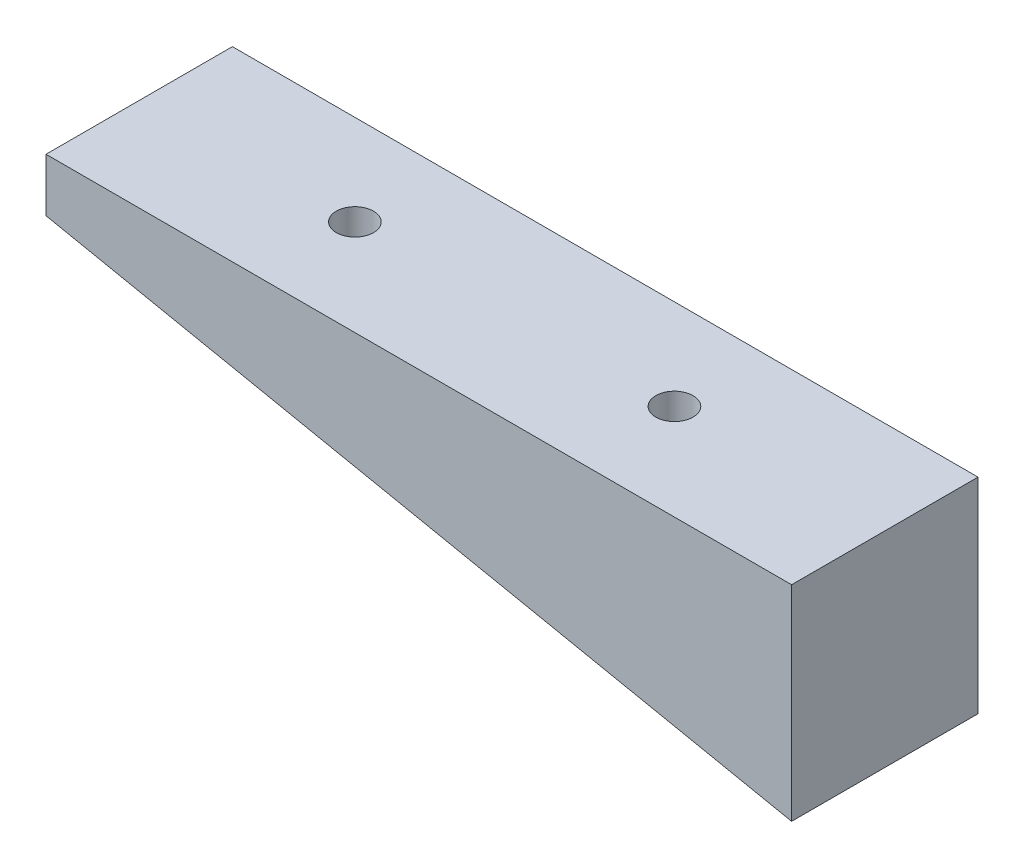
ISO-10303-21;
HEADER;
FILE_DESCRIPTION(('STEP AP214'),'2;1');
FILE_NAME('part.step','',(''),(''),'','','');
FILE_SCHEMA(('AUTOMOTIVE_DESIGN { 1 0 10303 214 1 1 1 1 }'));
ENDSEC;
DATA;
#1=APPLICATION_CONTEXT('core data for automotive mechanical design processes');
#2=APPLICATION_PROTOCOL_DEFINITION('international standard','automotive_design',2000,#1);
#3=PRODUCT_CONTEXT('',#1,'mechanical');
#4=PRODUCT('Part','Part','',(#3));
#5=PRODUCT_RELATED_PRODUCT_CATEGORY('part','',(#4));
#6=PRODUCT_DEFINITION_FORMATION('','',#4);
#7=PRODUCT_DEFINITION_CONTEXT('part definition',#1,'design');
#8=PRODUCT_DEFINITION('design','',#6,#7);
#9=PRODUCT_DEFINITION_SHAPE('','',#8);
#10=(LENGTH_UNIT() NAMED_UNIT(*) SI_UNIT(.MILLI.,.METRE.));
#11=(NAMED_UNIT(*) PLANE_ANGLE_UNIT() SI_UNIT($,.RADIAN.));
#12=(NAMED_UNIT(*) SI_UNIT($,.STERADIAN.) SOLID_ANGLE_UNIT());
#13=UNCERTAINTY_MEASURE_WITH_UNIT(LENGTH_MEASURE(1.E-05),#10,'distance_accuracy_value','');
#14=(GEOMETRIC_REPRESENTATION_CONTEXT(3) GLOBAL_UNCERTAINTY_ASSIGNED_CONTEXT((#13)) GLOBAL_UNIT_ASSIGNED_CONTEXT((#10,
#11,#12)) REPRESENTATION_CONTEXT('',''));
#15=CARTESIAN_POINT('',(0.,0.,0.));
#16=DIRECTION('',(0.,0.,1.));
#17=DIRECTION('',(1.,0.,0.));
#18=AXIS2_PLACEMENT_3D('',#15,#16,#17);
#19=CARTESIAN_POINT('',(44.4846801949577,19.9025072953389,34.));
#20=DIRECTION('',(0.,-1.,0.));
#21=DIRECTION('',(0.,0.,-1.));
#22=AXIS2_PLACEMENT_3D('',#19,#20,#21);
#23=CYLINDRICAL_SURFACE('',#22,11.);
#24=CARTESIAN_POINT('',(44.4846801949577,-1.37367665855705,34.));
#25=DIRECTION('',(-0.199367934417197,-0.97992470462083,0.));
#26=DIRECTION('',(0.97992470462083,-0.199367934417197,0.));
#27=AXIS2_PLACEMENT_3D('',#24,#25,#26);
#28=ELLIPSE('',#27,11.225352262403,11.);
#29=CARTESIAN_POINT('',(55.4846801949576,-3.61165195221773,34.));
#30=VERTEX_POINT('',#29);
#31=EDGE_CURVE('E20',#30,#30,#28,.F.);
#32=ORIENTED_EDGE('',*,*,#31,.F.);
#33=EDGE_LOOP('',(#32));
#34=FACE_BOUND('',#33,.T.);
#35=CARTESIAN_POINT('',(44.4846801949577,19.9025072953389,34.));
#36=DIRECTION('',(0.,-1.,0.));
#37=DIRECTION('',(0.,0.,-1.));
#38=AXIS2_PLACEMENT_3D('',#35,#36,#37);
#39=CIRCLE('',#38,11.);
#40=CARTESIAN_POINT('',(44.4846801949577,19.9025072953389,23.));
#41=VERTEX_POINT('',#40);
#42=EDGE_CURVE('E107',#41,#41,#39,.F.);
#43=ORIENTED_EDGE('',*,*,#42,.T.);
#44=EDGE_LOOP('',(#43));
#45=FACE_BOUND('',#44,.T.);
#46=ADVANCED_FACE('F16',(#34,#45),#23,.F.);
#47=CARTESIAN_POINT('',(164.484680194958,19.9025072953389,34.));
#48=DIRECTION('',(0.,-1.,0.));
#49=DIRECTION('',(1.,0.,0.));
#50=AXIS2_PLACEMENT_3D('',#47,#48,#49);
#51=CYLINDRICAL_SURFACE('',#50,11.);
#52=CARTESIAN_POINT('',(164.484680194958,-25.7879525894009,34.));
#53=DIRECTION('',(-0.199367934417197,-0.97992470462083,0.));
#54=DIRECTION('',(0.97992470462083,-0.199367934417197,0.));
#55=AXIS2_PLACEMENT_3D('',#52,#53,#54);
#56=ELLIPSE('',#55,11.225352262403,11.);
#57=CARTESIAN_POINT('',(175.484680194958,-28.0259278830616,34.));
#58=VERTEX_POINT('',#57);
#59=EDGE_CURVE('E109',#58,#58,#56,.F.);
#60=ORIENTED_EDGE('',*,*,#59,.F.);
#61=EDGE_LOOP('',(#60));
#62=FACE_BOUND('',#61,.T.);
#63=CARTESIAN_POINT('',(164.484680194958,19.9025072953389,34.));
#64=DIRECTION('',(0.,-1.,0.));
#65=DIRECTION('',(1.,0.,0.));
#66=AXIS2_PLACEMENT_3D('',#63,#64,#65);
#67=CIRCLE('',#66,11.);
#68=CARTESIAN_POINT('',(175.484680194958,19.9025072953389,34.));
#69=VERTEX_POINT('',#68);
#70=EDGE_CURVE('E70',#69,#69,#67,.F.);
#71=ORIENTED_EDGE('',*,*,#70,.T.);
#72=EDGE_LOOP('',(#71));
#73=FACE_BOUND('',#72,.T.);
#74=ADVANCED_FACE('F119',(#62,#73),#51,.F.);
#75=CARTESIAN_POINT('',(244.484680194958,-42.0641365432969,0.));
#76=DIRECTION('',(-0.199367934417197,-0.97992470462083,0.));
#77=DIRECTION('',(0.97992470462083,-0.199367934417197,0.));
#78=AXIS2_PLACEMENT_3D('',#75,#76,#77);
#79=PLANE('',#78);
#80=ORIENTED_EDGE('',*,*,#59,.T.);
#81=EDGE_LOOP('',(#80));
#82=FACE_BOUND('',#81,.T.);
#83=ORIENTED_EDGE('',*,*,#31,.T.);
#84=EDGE_LOOP('',(#83));
#85=FACE_BOUND('',#84,.T.);
#86=DIRECTION('',(0.97992470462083,-0.199367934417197,0.));
#87=VECTOR('',#86,1.);
#88=CARTESIAN_POINT('',(-35.5153198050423,14.9025072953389,0.));
#89=LINE('',#88,#87);
#90=CARTESIAN_POINT('',(-35.5153198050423,14.9025072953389,0.));
#91=VERTEX_POINT('',#90);
#92=CARTESIAN_POINT('',(244.484680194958,-42.0641365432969,0.));
#93=VERTEX_POINT('',#92);
#94=EDGE_CURVE('E53',#91,#93,#89,.T.);
#95=ORIENTED_EDGE('',*,*,#94,.T.);
#96=DIRECTION('',(0.,0.,-1.));
#97=VECTOR('',#96,1.);
#98=CARTESIAN_POINT('',(244.484680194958,-42.0641365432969,0.));
#99=LINE('',#98,#97);
#100=CARTESIAN_POINT('',(244.484680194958,-42.0641365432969,70.));
#101=VERTEX_POINT('',#100);
#102=EDGE_CURVE('E73',#101,#93,#99,.T.);
#103=ORIENTED_EDGE('',*,*,#102,.F.);
#104=DIRECTION('',(0.97992470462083,-0.199367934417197,0.));
#105=VECTOR('',#104,1.);
#106=CARTESIAN_POINT('',(-35.5153198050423,14.9025072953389,70.));
#107=LINE('',#106,#105);
#108=CARTESIAN_POINT('',(-35.5153198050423,14.9025072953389,70.));
#109=VERTEX_POINT('',#108);
#110=EDGE_CURVE('E61',#109,#101,#107,.T.);
#111=ORIENTED_EDGE('',*,*,#110,.F.);
#112=DIRECTION('',(0.,0.,1.));
#113=VECTOR('',#112,1.);
#114=CARTESIAN_POINT('',(-35.5153198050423,14.9025072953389,0.));
#115=LINE('',#114,#113);
#116=EDGE_CURVE('E85',#91,#109,#115,.T.);
#117=ORIENTED_EDGE('',*,*,#116,.F.);
#118=EDGE_LOOP('',(#95,#103,#111,#117));
#119=FACE_BOUND('',#118,.T.);
#120=ADVANCED_FACE('F74',(#82,#85,#119),#79,.T.);
#121=CARTESIAN_POINT('',(55.4846801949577,19.9025072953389,22.78));
#122=DIRECTION('',(0.,1.,0.));
#123=DIRECTION('',(-1.,0.,0.));
#124=AXIS2_PLACEMENT_3D('',#121,#122,#123);
#125=PLANE('',#124);
#126=CARTESIAN_POINT('',(44.4846801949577,19.9025072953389,34.));
#127=DIRECTION('',(0.,1.,0.));
#128=DIRECTION('',(0.,0.,1.));
#129=AXIS2_PLACEMENT_3D('',#126,#127,#128);
#130=CIRCLE('',#129,7.);
#131=CARTESIAN_POINT('',(44.4846801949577,19.9025072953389,41.));
#132=VERTEX_POINT('',#131);
#133=EDGE_CURVE('E87',#132,#132,#130,.T.);
#134=ORIENTED_EDGE('',*,*,#133,.T.);
#135=EDGE_LOOP('',(#134));
#136=FACE_BOUND('',#135,.T.);
#137=ORIENTED_EDGE('',*,*,#42,.F.);
#138=EDGE_LOOP('',(#137));
#139=FACE_BOUND('',#138,.T.);
#140=ADVANCED_FACE('F123',(#136,#139),#125,.F.);
#141=CARTESIAN_POINT('',(175.484680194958,19.9025072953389,22.78));
#142=DIRECTION('',(0.,1.,0.));
#143=DIRECTION('',(-1.,0.,0.));
#144=AXIS2_PLACEMENT_3D('',#141,#142,#143);
#145=PLANE('',#144);
#146=CARTESIAN_POINT('',(164.484680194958,19.9025072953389,34.));
#147=DIRECTION('',(0.,1.,0.));
#148=DIRECTION('',(0.,0.,1.));
#149=AXIS2_PLACEMENT_3D('',#146,#147,#148);
#150=CIRCLE('',#149,7.);
#151=CARTESIAN_POINT('',(164.484680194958,19.9025072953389,41.));
#152=VERTEX_POINT('',#151);
#153=EDGE_CURVE('E97',#152,#152,#150,.T.);
#154=ORIENTED_EDGE('',*,*,#153,.T.);
#155=EDGE_LOOP('',(#154));
#156=FACE_BOUND('',#155,.T.);
#157=ORIENTED_EDGE('',*,*,#70,.F.);
#158=EDGE_LOOP('',(#157));
#159=FACE_BOUND('',#158,.T.);
#160=ADVANCED_FACE('F18',(#156,#159),#145,.F.);
#161=CARTESIAN_POINT('',(116.519228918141,9.22678648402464,70.));
#162=DIRECTION('',(0.,0.,1.));
#163=DIRECTION('',(1.,0.,0.));
#164=AXIS2_PLACEMENT_3D('',#161,#162,#163);
#165=PLANE('',#164);
#166=DIRECTION('',(0.,1.,0.));
#167=VECTOR('',#166,1.);
#168=CARTESIAN_POINT('',(-35.5153198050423,14.9025072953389,70.));
#169=LINE('',#168,#167);
#170=CARTESIAN_POINT('',(-35.5153198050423,34.9025072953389,70.));
#171=VERTEX_POINT('',#170);
#172=EDGE_CURVE('E67',#109,#171,#169,.T.);
#173=ORIENTED_EDGE('',*,*,#172,.F.);
#174=ORIENTED_EDGE('',*,*,#110,.T.);
#175=DIRECTION('',(0.,1.,0.));
#176=VECTOR('',#175,1.);
#177=CARTESIAN_POINT('',(244.484680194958,34.9025072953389,70.));
#178=LINE('',#177,#176);
#179=CARTESIAN_POINT('',(244.484680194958,34.9025072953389,70.));
#180=VERTEX_POINT('',#179);
#181=EDGE_CURVE('E65',#180,#101,#178,.F.);
#182=ORIENTED_EDGE('',*,*,#181,.F.);
#183=DIRECTION('',(1.,0.,0.));
#184=VECTOR('',#183,1.);
#185=CARTESIAN_POINT('',(-35.5153198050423,34.9025072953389,70.));
#186=LINE('',#185,#184);
#187=EDGE_CURVE('E49',#171,#180,#186,.T.);
#188=ORIENTED_EDGE('',*,*,#187,.F.);
#189=EDGE_LOOP('',(#173,#174,#182,#188));
#190=FACE_BOUND('',#189,.T.);
#191=ADVANCED_FACE('F63',(#190),#165,.T.);
#192=CARTESIAN_POINT('',(244.484680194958,34.9025072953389,0.));
#193=DIRECTION('',(1.,0.,0.));
#194=DIRECTION('',(0.,0.,-1.));
#195=AXIS2_PLACEMENT_3D('',#192,#193,#194);
#196=PLANE('',#195);
#197=DIRECTION('',(0.,1.,0.));
#198=VECTOR('',#197,1.);
#199=CARTESIAN_POINT('',(244.484680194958,9.22678648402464,0.));
#200=LINE('',#199,#198);
#201=CARTESIAN_POINT('',(244.484680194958,34.9025072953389,0.));
#202=VERTEX_POINT('',#201);
#203=EDGE_CURVE('E82',#93,#202,#200,.T.);
#204=ORIENTED_EDGE('',*,*,#203,.T.);
#205=DIRECTION('',(0.,0.,1.));
#206=VECTOR('',#205,1.);
#207=CARTESIAN_POINT('',(244.484680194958,34.9025072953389,0.));
#208=LINE('',#207,#206);
#209=EDGE_CURVE('E79',#180,#202,#208,.F.);
#210=ORIENTED_EDGE('',*,*,#209,.F.);
#211=ORIENTED_EDGE('',*,*,#181,.T.);
#212=ORIENTED_EDGE('',*,*,#102,.T.);
#213=EDGE_LOOP('',(#204,#210,#211,#212));
#214=FACE_BOUND('',#213,.T.);
#215=ADVANCED_FACE('F77',(#214),#196,.T.);
#216=CARTESIAN_POINT('',(116.519228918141,9.22678648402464,0.));
#217=DIRECTION('',(0.,0.,1.));
#218=DIRECTION('',(1.,0.,0.));
#219=AXIS2_PLACEMENT_3D('',#216,#217,#218);
#220=PLANE('',#219);
#221=ORIENTED_EDGE('',*,*,#203,.F.);
#222=ORIENTED_EDGE('',*,*,#94,.F.);
#223=DIRECTION('',(0.,1.,0.));
#224=VECTOR('',#223,1.);
#225=CARTESIAN_POINT('',(-35.5153198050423,14.9025072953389,0.));
#226=LINE('',#225,#224);
#227=CARTESIAN_POINT('',(-35.5153198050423,34.9025072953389,0.));
#228=VERTEX_POINT('',#227);
#229=EDGE_CURVE('E35',#228,#91,#226,.F.);
#230=ORIENTED_EDGE('',*,*,#229,.F.);
#231=DIRECTION('',(1.,0.,0.));
#232=VECTOR('',#231,1.);
#233=CARTESIAN_POINT('',(-35.5153198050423,34.9025072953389,0.));
#234=LINE('',#233,#232);
#235=EDGE_CURVE('E93',#202,#228,#234,.F.);
#236=ORIENTED_EDGE('',*,*,#235,.F.);
#237=EDGE_LOOP('',(#221,#222,#230,#236));
#238=FACE_BOUND('',#237,.T.);
#239=ADVANCED_FACE('F160',(#238),#220,.F.);
#240=CARTESIAN_POINT('',(-35.5153198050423,14.9025072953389,0.));
#241=DIRECTION('',(-1.,0.,0.));
#242=DIRECTION('',(0.,0.,1.));
#243=AXIS2_PLACEMENT_3D('',#240,#241,#242);
#244=PLANE('',#243);
#245=ORIENTED_EDGE('',*,*,#229,.T.);
#246=ORIENTED_EDGE('',*,*,#116,.T.);
#247=ORIENTED_EDGE('',*,*,#172,.T.);
#248=DIRECTION('',(0.,0.,1.));
#249=VECTOR('',#248,1.);
#250=CARTESIAN_POINT('',(-35.5153198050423,34.9025072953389,0.));
#251=LINE('',#250,#249);
#252=EDGE_CURVE('E90',#228,#171,#251,.T.);
#253=ORIENTED_EDGE('',*,*,#252,.F.);
#254=EDGE_LOOP('',(#245,#246,#247,#253));
#255=FACE_BOUND('',#254,.T.);
#256=ADVANCED_FACE('F164',(#255),#244,.T.);
#257=CARTESIAN_POINT('',(44.4846801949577,318.606146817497,34.));
#258=DIRECTION('',(0.,1.,0.));
#259=DIRECTION('',(0.,0.,1.));
#260=AXIS2_PLACEMENT_3D('',#257,#258,#259);
#261=CYLINDRICAL_SURFACE('',#260,7.);
#262=ORIENTED_EDGE('',*,*,#133,.F.);
#263=EDGE_LOOP('',(#262));
#264=FACE_BOUND('',#263,.T.);
#265=CARTESIAN_POINT('',(44.4846801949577,34.9025072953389,34.));
#266=DIRECTION('',(0.,1.,0.));
#267=DIRECTION('',(0.,0.,1.));
#268=AXIS2_PLACEMENT_3D('',#265,#266,#267);
#269=CIRCLE('',#268,7.);
#270=CARTESIAN_POINT('',(44.4846801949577,34.9025072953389,41.));
#271=VERTEX_POINT('',#270);
#272=EDGE_CURVE('E26',#271,#271,#269,.F.);
#273=ORIENTED_EDGE('',*,*,#272,.F.);
#274=EDGE_LOOP('',(#273));
#275=FACE_BOUND('',#274,.T.);
#276=ADVANCED_FACE('F140',(#264,#275),#261,.F.);
#277=CARTESIAN_POINT('',(164.484680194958,318.606146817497,34.));
#278=DIRECTION('',(0.,1.,0.));
#279=DIRECTION('',(0.,0.,1.));
#280=AXIS2_PLACEMENT_3D('',#277,#278,#279);
#281=CYLINDRICAL_SURFACE('',#280,7.);
#282=ORIENTED_EDGE('',*,*,#153,.F.);
#283=EDGE_LOOP('',(#282));
#284=FACE_BOUND('',#283,.T.);
#285=CARTESIAN_POINT('',(164.484680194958,34.9025072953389,34.));
#286=DIRECTION('',(0.,1.,0.));
#287=DIRECTION('',(0.,0.,1.));
#288=AXIS2_PLACEMENT_3D('',#285,#286,#287);
#289=CIRCLE('',#288,7.);
#290=CARTESIAN_POINT('',(164.484680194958,34.9025072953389,41.));
#291=VERTEX_POINT('',#290);
#292=EDGE_CURVE('E10',#291,#291,#289,.F.);
#293=ORIENTED_EDGE('',*,*,#292,.F.);
#294=EDGE_LOOP('',(#293));
#295=FACE_BOUND('',#294,.T.);
#296=ADVANCED_FACE('F135',(#284,#295),#281,.F.);
#297=CARTESIAN_POINT('',(-35.5153198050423,34.9025072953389,0.));
#298=DIRECTION('',(0.,1.,0.));
#299=DIRECTION('',(0.,0.,1.));
#300=AXIS2_PLACEMENT_3D('',#297,#298,#299);
#301=PLANE('',#300);
#302=ORIENTED_EDGE('',*,*,#292,.T.);
#303=EDGE_LOOP('',(#302));
#304=FACE_BOUND('',#303,.T.);
#305=ORIENTED_EDGE('',*,*,#272,.T.);
#306=EDGE_LOOP('',(#305));
#307=FACE_BOUND('',#306,.T.);
#308=ORIENTED_EDGE('',*,*,#235,.T.);
#309=ORIENTED_EDGE('',*,*,#252,.T.);
#310=ORIENTED_EDGE('',*,*,#187,.T.);
#311=ORIENTED_EDGE('',*,*,#209,.T.);
#312=EDGE_LOOP('',(#308,#309,#310,#311));
#313=FACE_BOUND('',#312,.T.);
#314=ADVANCED_FACE('F133',(#304,#307,#313),#301,.T.);
#315=CLOSED_SHELL('',(#46,#74,#120,#140,#160,#191,#215,#239,#256,#276,#296,#314));
#316=MANIFOLD_SOLID_BREP('B1',#315);
#317=ADVANCED_BREP_SHAPE_REPRESENTATION('',(#18,#316),#14);
#318=SHAPE_DEFINITION_REPRESENTATION(#9,#317);
ENDSEC;
END-ISO-10303-21;
